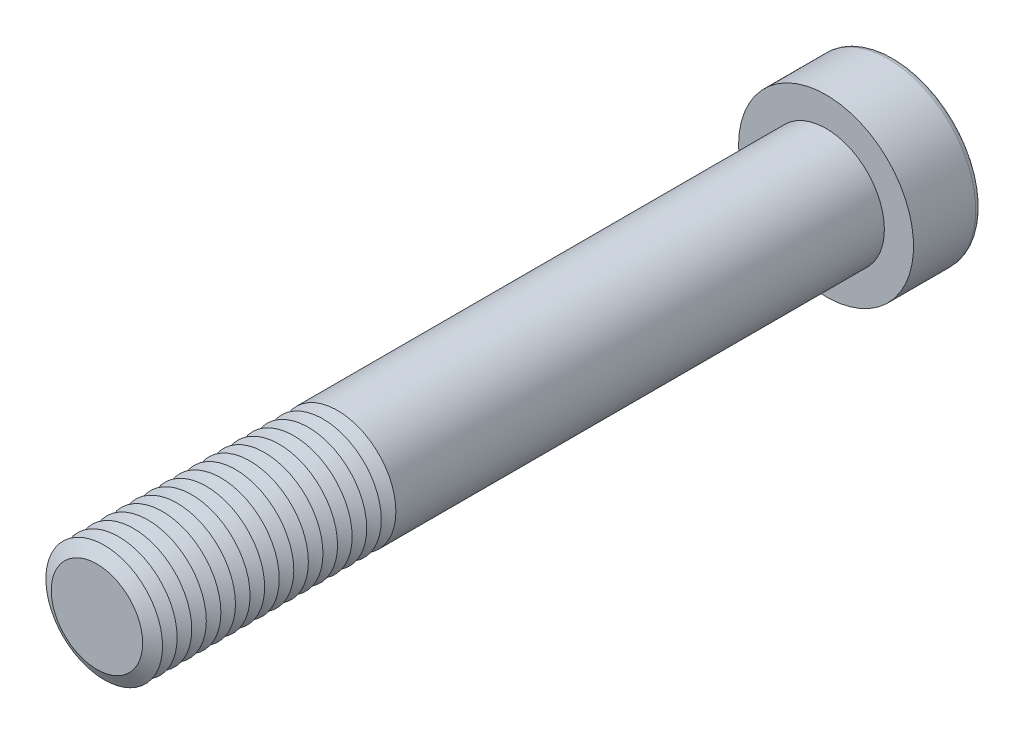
from build123d import *

# Parameters (mm, degrees)
SKETCH1_R           = 12
BOSS_EXTRUDE1_DEPTH = 150
SKETCH2_R           = 18
BOSS_EXTRUDE2_DEPTH = 14
CUT_EXTRUDE1_DEPTH  = 14.25
FILLET1_R           = 1.2
LPATTERN1_COUNT     = 17
LPATTERN1_PITCH     = 3


with BuildPart() as part:
    # Sketch1 → Boss-Extrude1 (new body)
    with BuildSketch(Plane.XY):
        Circle(SKETCH1_R)
    extrude(amount=BOSS_EXTRUDE1_DEPTH)

    # Sketch2 → Boss-Extrude2 (add)
    with BuildSketch(Plane(origin=(0, 0, 0), x_dir=(-1, 0, 0), z_dir=(0, 0, -1))):
        Circle(SKETCH2_R)
    extrude(amount=BOSS_EXTRUDE2_DEPTH)

    # Sketch3 → Cut-Extrude1 (cut)
    with BuildSketch(Plane(origin=(0, 0, -14), x_dir=(-1, 0, 0), z_dir=(0, 0, -1))):
        Polygon((-5.484827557, 9.5), (-10.969655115, 0), (-5.484827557, -9.5), (5.484827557, -9.5), (10.969655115, 0), (5.484827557, 9.5), align=None)
    extrude(amount=-CUT_EXTRUDE1_DEPTH, mode=Mode.SUBTRACT)

    # Fillet1
    fillet1_edges = [part.edges().sort_by_distance(p)[0] for p in [
        (18, 0, -14),
    ]]
    fillet(fillet1_edges, radius=FILLET1_R)

    # Cut-Extrude2 cone 1 section (on through the dimple's axis) → Cut-Extrude2 (revolve, cut)
    with BuildSketch(Plane(origin=(0, 0, 0.25), x_dir=(0, 1, 0), z_dir=(1, 0, 0))):
        Polygon((0, 0), (9.5, 0), (0, 5.484827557), align=None)
    revolve(axis=Axis((0, 0, 0.25), (0, 0, 1)), mode=Mode.SUBTRACT)

    # Cut-Extrude3 cone 1 section (on through the dimple's axis) → Cut-Extrude3 (revolve, cut)
    with BuildSketch(Plane(origin=(0, 0, -14), x_dir=(0, 1, 0), z_dir=(1, 0, 0))):
        Polygon((0, 0), (10.969655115, 0), (0, 2.939310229), align=None)
    revolve(axis=Axis((0, 0, -14), (0, 0, 1)), mode=Mode.SUBTRACT)

    # Sketch7 → Cut-Revolve1 (revolve, cut)
    with BuildSketch(Plane(origin=(0, 0, 0), x_dir=(0, 0, -1), z_dir=(1, 0, 0)), mode=Mode.PRIVATE) as cut_revolve1_sk:
        Polygon((-150, 9.401923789), (-148.5, 12), (-151.5, 12), align=None)
    cut_revolve1 = revolve(cut_revolve1_sk.sketch.rotate(Axis((0, 0, 150), (0, 0, -1)), 90), axis=Axis((0, 0, 150), (0, 0, -1)), mode=Mode.SUBTRACT)

    # LPattern1: Cut-Revolve1 ×17
    with Locations(*[(0, 0, -i * LPATTERN1_PITCH) for i in range(1, LPATTERN1_COUNT)]):
        add(cut_revolve1, mode=Mode.SUBTRACT)


solid = part.part
